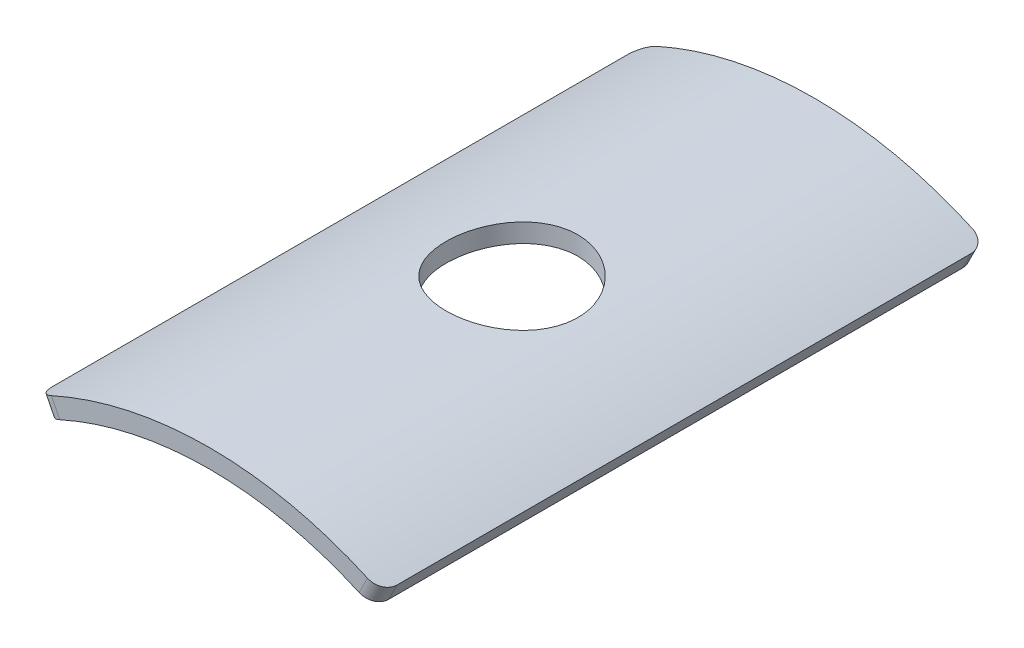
ISO-10303-21;
HEADER;
FILE_DESCRIPTION(('STEP AP214'),'2;1');
FILE_NAME('part.step','',(''),(''),'','','');
FILE_SCHEMA(('AUTOMOTIVE_DESIGN { 1 0 10303 214 1 1 1 1 }'));
ENDSEC;
DATA;
#1=APPLICATION_CONTEXT('core data for automotive mechanical design processes');
#2=APPLICATION_PROTOCOL_DEFINITION('international standard','automotive_design',2000,#1);
#3=PRODUCT_CONTEXT('',#1,'mechanical');
#4=PRODUCT('Part','Part','',(#3));
#5=PRODUCT_RELATED_PRODUCT_CATEGORY('part','',(#4));
#6=PRODUCT_DEFINITION_FORMATION('','',#4);
#7=PRODUCT_DEFINITION_CONTEXT('part definition',#1,'design');
#8=PRODUCT_DEFINITION('design','',#6,#7);
#9=PRODUCT_DEFINITION_SHAPE('','',#8);
#10=(LENGTH_UNIT() NAMED_UNIT(*) SI_UNIT(.MILLI.,.METRE.));
#11=(NAMED_UNIT(*) PLANE_ANGLE_UNIT() SI_UNIT($,.RADIAN.));
#12=(NAMED_UNIT(*) SI_UNIT($,.STERADIAN.) SOLID_ANGLE_UNIT());
#13=UNCERTAINTY_MEASURE_WITH_UNIT(LENGTH_MEASURE(1.E-05),#10,'distance_accuracy_value','');
#14=(GEOMETRIC_REPRESENTATION_CONTEXT(3) GLOBAL_UNCERTAINTY_ASSIGNED_CONTEXT((#13)) GLOBAL_UNIT_ASSIGNED_CONTEXT((#10,
#11,#12)) REPRESENTATION_CONTEXT('',''));
#15=CARTESIAN_POINT('',(0.,0.,0.));
#16=DIRECTION('',(0.,0.,1.));
#17=DIRECTION('',(1.,0.,0.));
#18=AXIS2_PLACEMENT_3D('',#15,#16,#17);
#19=CARTESIAN_POINT('',(0.,-21.0105,19.5));
#20=DIRECTION('',(0.,0.,-1.));
#21=DIRECTION('',(-1.,0.,0.));
#22=AXIS2_PLACEMENT_3D('',#19,#20,#21);
#23=CYLINDRICAL_SURFACE('',#22,23.5105);
#24=DIRECTION('',(0.,0.,-1.));
#25=VECTOR('',#24,1.);
#26=CARTESIAN_POINT('',(-10.55,0.,19.5));
#27=LINE('',#26,#25);
#28=CARTESIAN_POINT('',(-10.55,0.,18.5));
#29=VERTEX_POINT('',#28);
#30=CARTESIAN_POINT('',(-10.55,0.,-18.5));
#31=VERTEX_POINT('',#30);
#32=EDGE_CURVE('E106',#29,#31,#27,.T.);
#33=ORIENTED_EDGE('',*,*,#32,.T.);
#34=CARTESIAN_POINT('',(-10.55,0.,-18.5));
#35=CARTESIAN_POINT('',(-10.5499997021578,-1.76009192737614E-07,-18.5281342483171));
#36=CARTESIAN_POINT('',(-10.5489382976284,0.000533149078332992,-18.5562550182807));
#37=CARTESIAN_POINT('',(-10.5447030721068,0.00265910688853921,-18.6122953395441));
#38=CARTESIAN_POINT('',(-10.5415293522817,0.00425168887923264,-18.6402149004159));
#39=CARTESIAN_POINT('',(-10.5288681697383,0.0105998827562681,-18.7233231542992));
#40=CARTESIAN_POINT('',(-10.516240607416,0.0169259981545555,-18.7779551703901));
#41=CARTESIAN_POINT('',(-10.4829400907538,0.0335471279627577,-18.8840711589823));
#42=CARTESIAN_POINT('',(-10.4622632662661,0.0438440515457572,-18.9355536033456));
#43=CARTESIAN_POINT('',(-10.4134190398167,0.0680448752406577,-19.0339081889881));
#44=CARTESIAN_POINT('',(-10.3852529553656,0.0819481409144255,-19.0807811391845));
#45=CARTESIAN_POINT('',(-10.3221899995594,0.112881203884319,-19.1685824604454));
#46=CARTESIAN_POINT('',(-10.28729370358,0.129910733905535,-19.2095113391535));
#47=CARTESIAN_POINT('',(-10.2117060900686,0.166525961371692,-19.284277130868));
#48=CARTESIAN_POINT('',(-10.1710136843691,0.186112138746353,-19.3181127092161));
#49=CARTESIAN_POINT('',(-10.0849648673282,0.227187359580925,-19.3777164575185));
#50=CARTESIAN_POINT('',(-10.0396090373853,0.248676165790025,-19.4034856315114));
#51=CARTESIAN_POINT('',(-9.94548813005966,0.292869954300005,-19.4462243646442));
#52=CARTESIAN_POINT('',(-9.89672502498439,0.315574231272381,-19.4631989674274));
#53=CARTESIAN_POINT('',(-9.81419008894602,0.35364259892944,-19.4836714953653));
#54=CARTESIAN_POINT('',(-9.78098069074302,0.368867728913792,-19.4897915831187));
#55=CARTESIAN_POINT('',(-9.71412690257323,0.39932741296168,-19.4979553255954));
#56=CARTESIAN_POINT('',(-9.6804832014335,0.414561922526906,-19.5000047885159));
#57=CARTESIAN_POINT('',(-9.64678784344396,0.429721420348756,-19.5));
#58=B_SPLINE_CURVE_WITH_KNOTS('',3,(#34,#35,#36,#37,#38,#39,#40,#41,#42,#43,#44,#45,#46,#47,#48,
#49,#50,#51,#52,#53,#54,#55,#56,#57),.UNSPECIFIED.,.F.,.F.,(4,2,2,2,2,2,2,2,2,2,2,4),(0.,
0.0843509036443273,0.168697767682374,0.337113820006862,0.505610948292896,0.67407845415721,
0.84253156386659,1.01101634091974,1.17948013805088,1.34784721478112,1.45876210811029,
1.56951862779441),.UNSPECIFIED.);
#59=CARTESIAN_POINT('',(-9.64678784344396,0.429721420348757,-19.5));
#60=VERTEX_POINT('',#59);
#61=EDGE_CURVE('E101',#31,#60,#58,.T.);
#62=ORIENTED_EDGE('',*,*,#61,.T.);
#63=CARTESIAN_POINT('',(0.,-21.0105,-19.5));
#64=DIRECTION('',(0.,0.,-1.));
#65=DIRECTION('',(-1.,0.,0.));
#66=AXIS2_PLACEMENT_3D('',#63,#64,#65);
#67=CIRCLE('',#66,23.5105);
#68=CARTESIAN_POINT('',(9.64678784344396,0.42972142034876,-19.5));
#69=VERTEX_POINT('',#68);
#70=EDGE_CURVE('E104',#60,#69,#67,.T.);
#71=ORIENTED_EDGE('',*,*,#70,.T.);
#72=CARTESIAN_POINT('',(9.64678784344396,0.429721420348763,-19.5));
#73=CARTESIAN_POINT('',(9.67244299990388,0.41817847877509,-19.4999998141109));
#74=CARTESIAN_POINT('',(9.69806496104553,0.406594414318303,-19.4988142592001));
#75=CARTESIAN_POINT('',(9.74908504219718,0.383418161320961,-19.4940835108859));
#76=CARTESIAN_POINT('',(9.77448317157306,0.371825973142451,-19.490538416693));
#77=CARTESIAN_POINT('',(9.85002634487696,0.337184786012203,-19.4763957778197));
#78=CARTESIAN_POINT('',(9.89960520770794,0.314232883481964,-19.4622907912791));
#79=CARTESIAN_POINT('',(9.99576272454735,0.269329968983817,-19.4251118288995));
#80=CARTESIAN_POINT('',(10.0423398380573,0.247379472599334,-19.4020332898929));
#81=CARTESIAN_POINT('',(10.1311988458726,0.205174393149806,-19.3475617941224));
#82=CARTESIAN_POINT('',(10.1734815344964,0.184919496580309,-19.3161703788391));
#83=CARTESIAN_POINT('',(10.2525718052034,0.146775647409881,-19.245979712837));
#84=CARTESIAN_POINT('',(10.2893820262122,0.128885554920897,-19.2071840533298));
#85=CARTESIAN_POINT('',(10.3565609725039,0.0960548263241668,-19.123265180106));
#86=CARTESIAN_POINT('',(10.3869284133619,0.0811147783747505,-19.0781407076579));
#87=CARTESIAN_POINT('',(10.4404035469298,0.054695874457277,-18.9828380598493));
#88=CARTESIAN_POINT('',(10.4635083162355,0.043218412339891,-18.9326578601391));
#89=CARTESIAN_POINT('',(10.5018146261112,0.0241371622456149,-18.8286891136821));
#90=CARTESIAN_POINT('',(10.5170207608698,0.0165311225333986,-18.774902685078));
#91=CARTESIAN_POINT('',(10.5353652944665,0.00734371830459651,-18.6839921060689));
#92=CARTESIAN_POINT('',(10.5408504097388,0.0045924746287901,-18.6474381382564));
#93=CARTESIAN_POINT('',(10.5481670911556,0.000920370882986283,-18.5739278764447));
#94=CARTESIAN_POINT('',(10.5500038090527,-3.07014575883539E-06,-18.5369722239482));
#95=CARTESIAN_POINT('',(10.55,0.,-18.5));
#96=B_SPLINE_CURVE_WITH_KNOTS('',3,(#72,#73,#74,#75,#76,#77,#78,#79,#80,#81,#82,#83,#84,#85,#86,
#87,#88,#89,#90,#91,#92,#93,#94,#95),.UNSPECIFIED.,.F.,.F.,(4,2,2,2,2,2,2,2,2,2,2,4),(0.,
0.0843452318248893,0.168686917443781,0.337094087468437,0.50558700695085,0.674048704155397,
0.842428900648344,1.01084263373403,1.1793240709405,1.34770740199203,1.4586915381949,
1.56951884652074),.UNSPECIFIED.);
#97=CARTESIAN_POINT('',(10.55,0.,-18.5));
#98=VERTEX_POINT('',#97);
#99=EDGE_CURVE('E111',#69,#98,#96,.T.);
#100=ORIENTED_EDGE('',*,*,#99,.T.);
#101=DIRECTION('',(0.,0.,-1.));
#102=VECTOR('',#101,1.);
#103=CARTESIAN_POINT('',(10.55,0.,19.5));
#104=LINE('',#103,#102);
#105=CARTESIAN_POINT('',(10.55,0.,18.5));
#106=VERTEX_POINT('',#105);
#107=EDGE_CURVE('E220',#106,#98,#104,.T.);
#108=ORIENTED_EDGE('',*,*,#107,.F.);
#109=CARTESIAN_POINT('',(10.55,0.,18.5));
#110=CARTESIAN_POINT('',(10.5499997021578,-1.76009189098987E-07,18.5281342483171));
#111=CARTESIAN_POINT('',(10.5489382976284,0.000533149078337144,18.5562550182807));
#112=CARTESIAN_POINT('',(10.5447030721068,0.00265910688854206,18.6122953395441));
#113=CARTESIAN_POINT('',(10.5415293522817,0.00425168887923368,18.6402149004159));
#114=CARTESIAN_POINT('',(10.5288681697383,0.0105998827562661,18.7233231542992));
#115=CARTESIAN_POINT('',(10.516240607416,0.0169259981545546,18.7779551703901));
#116=CARTESIAN_POINT('',(10.4829400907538,0.0335471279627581,18.8840711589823));
#117=CARTESIAN_POINT('',(10.462263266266,0.0438440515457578,18.9355536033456));
#118=CARTESIAN_POINT('',(10.4134190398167,0.0680448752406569,19.0339081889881));
#119=CARTESIAN_POINT('',(10.3852529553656,0.0819481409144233,19.0807811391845));
#120=CARTESIAN_POINT('',(10.3221899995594,0.11288120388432,19.1685824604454));
#121=CARTESIAN_POINT('',(10.28729370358,0.129910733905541,19.2095113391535));
#122=CARTESIAN_POINT('',(10.2117060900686,0.166525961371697,19.284277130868));
#123=CARTESIAN_POINT('',(10.1710136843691,0.186112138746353,19.3181127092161));
#124=CARTESIAN_POINT('',(10.0849648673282,0.227187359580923,19.3777164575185));
#125=CARTESIAN_POINT('',(10.0396090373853,0.248676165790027,19.4034856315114));
#126=CARTESIAN_POINT('',(9.94548813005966,0.292869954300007,19.4462243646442));
#127=CARTESIAN_POINT('',(9.89672502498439,0.315574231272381,19.4631989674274));
#128=CARTESIAN_POINT('',(9.81419008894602,0.353642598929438,19.4836714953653));
#129=CARTESIAN_POINT('',(9.78098069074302,0.368867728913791,19.4897915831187));
#130=CARTESIAN_POINT('',(9.71412690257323,0.399327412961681,19.4979553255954));
#131=CARTESIAN_POINT('',(9.68048320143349,0.414561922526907,19.5000047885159));
#132=CARTESIAN_POINT('',(9.64678784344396,0.429721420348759,19.5));
#133=B_SPLINE_CURVE_WITH_KNOTS('',3,(#109,#110,#111,#112,#113,#114,#115,#116,#117,#118,#119,
#120,#121,#122,#123,#124,#125,#126,#127,#128,#129,#130,#131,#132),.UNSPECIFIED.,.F.,.F.,(4,2,2,
2,2,2,2,2,2,2,2,4),(0.,0.0843509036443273,0.168697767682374,0.337113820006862,0.505610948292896,
0.67407845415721,0.84253156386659,1.01101634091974,1.17948013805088,1.34784721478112,
1.45876210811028,1.56951862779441),.UNSPECIFIED.);
#134=CARTESIAN_POINT('',(9.64678784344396,0.42972142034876,19.5));
#135=VERTEX_POINT('',#134);
#136=EDGE_CURVE('E52',#106,#135,#133,.T.);
#137=ORIENTED_EDGE('',*,*,#136,.T.);
#138=CARTESIAN_POINT('',(0.,-21.0105,19.5));
#139=DIRECTION('',(0.,0.,-1.));
#140=DIRECTION('',(-1.,0.,0.));
#141=AXIS2_PLACEMENT_3D('',#138,#139,#140);
#142=CIRCLE('',#141,23.5105);
#143=CARTESIAN_POINT('',(-9.64678784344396,0.429721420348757,19.5));
#144=VERTEX_POINT('',#143);
#145=EDGE_CURVE('E252',#144,#135,#142,.T.);
#146=ORIENTED_EDGE('',*,*,#145,.F.);
#147=CARTESIAN_POINT('',(-9.64678784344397,0.429721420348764,19.5));
#148=CARTESIAN_POINT('',(-9.67244299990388,0.418178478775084,19.4999998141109));
#149=CARTESIAN_POINT('',(-9.69806496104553,0.406594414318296,19.4988142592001));
#150=CARTESIAN_POINT('',(-9.74908504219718,0.383418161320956,19.4940835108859));
#151=CARTESIAN_POINT('',(-9.77448317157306,0.37182597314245,19.490538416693));
#152=CARTESIAN_POINT('',(-9.85002634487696,0.337184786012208,19.4763957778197));
#153=CARTESIAN_POINT('',(-9.89960520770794,0.314232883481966,19.4622907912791));
#154=CARTESIAN_POINT('',(-9.99576272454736,0.269329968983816,19.4251118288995));
#155=CARTESIAN_POINT('',(-10.0423398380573,0.247379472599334,19.4020332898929));
#156=CARTESIAN_POINT('',(-10.1311988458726,0.205174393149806,19.3475617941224));
#157=CARTESIAN_POINT('',(-10.1734815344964,0.184919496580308,19.3161703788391));
#158=CARTESIAN_POINT('',(-10.2525718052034,0.146775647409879,19.245979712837));
#159=CARTESIAN_POINT('',(-10.2893820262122,0.128885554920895,19.2071840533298));
#160=CARTESIAN_POINT('',(-10.3565609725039,0.0960548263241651,19.123265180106));
#161=CARTESIAN_POINT('',(-10.3869284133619,0.0811147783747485,19.0781407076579));
#162=CARTESIAN_POINT('',(-10.4404035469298,0.0546958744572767,18.9828380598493));
#163=CARTESIAN_POINT('',(-10.4635083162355,0.0432184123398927,18.9326578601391));
#164=CARTESIAN_POINT('',(-10.5018146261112,0.0241371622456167,18.8286891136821));
#165=CARTESIAN_POINT('',(-10.5170207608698,0.0165311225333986,18.774902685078));
#166=CARTESIAN_POINT('',(-10.5353652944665,0.00734371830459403,18.6839921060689));
#167=CARTESIAN_POINT('',(-10.5408504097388,0.00459247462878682,18.6474381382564));
#168=CARTESIAN_POINT('',(-10.5481670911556,0.000920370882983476,18.5739278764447));
#169=CARTESIAN_POINT('',(-10.5500038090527,-3.07014576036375E-06,18.5369722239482));
#170=CARTESIAN_POINT('',(-10.55,0.,18.5));
#171=B_SPLINE_CURVE_WITH_KNOTS('',3,(#147,#148,#149,#150,#151,#152,#153,#154,#155,#156,#157,
#158,#159,#160,#161,#162,#163,#164,#165,#166,#167,#168,#169,#170),.UNSPECIFIED.,.F.,.F.,(4,2,2,
2,2,2,2,2,2,2,2,4),(0.,0.0843452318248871,0.168686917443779,0.337094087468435,0.505587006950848,
0.674048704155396,0.842428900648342,1.01084263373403,1.1793240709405,1.34770740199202,
1.4586915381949,1.56951884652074),.UNSPECIFIED.);
#172=EDGE_CURVE('E185',#144,#29,#171,.T.);
#173=ORIENTED_EDGE('',*,*,#172,.T.);
#174=EDGE_LOOP('',(#33,#62,#71,#100,#108,#137,#146,#173));
#175=FACE_BOUND('',#174,.T.);
#176=CARTESIAN_POINT('',(0.,2.5,-4.25));
#177=CARTESIAN_POINT('',(0.236657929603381,2.49999577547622,-4.2499907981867));
#178=CARTESIAN_POINT('',(0.473437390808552,2.49638967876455,-4.23016603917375));
#179=CARTESIAN_POINT('',(0.940334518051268,2.48235170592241,-4.15143578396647));
#180=CARTESIAN_POINT('',(1.17044621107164,2.47191389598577,-4.09249631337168));
#181=CARTESIAN_POINT('',(1.61718701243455,2.44538115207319,-3.93739167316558));
#182=CARTESIAN_POINT('',(1.83382772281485,2.429291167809,-3.84125906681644));
#183=CARTESIAN_POINT('',(2.24788244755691,2.39321513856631,-3.61458710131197));
#184=CARTESIAN_POINT('',(2.44529822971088,2.37322945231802,-3.48405090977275));
#185=CARTESIAN_POINT('',(2.81752643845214,2.33132160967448,-3.19072863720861));
#186=CARTESIAN_POINT('',(2.99209306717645,2.30938208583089,-3.02763308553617));
#187=CARTESIAN_POINT('',(3.31154231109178,2.26616952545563,-2.6744876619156));
#188=CARTESIAN_POINT('',(3.45642288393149,2.24489653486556,-2.48443593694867));
#189=CARTESIAN_POINT('',(3.71339733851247,2.20525710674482,-2.08105208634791));
#190=CARTESIAN_POINT('',(3.82524350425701,2.18691308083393,-1.86755975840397));
#191=CARTESIAN_POINT('',(4.01138903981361,2.15545210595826,-1.42442905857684));
#192=CARTESIAN_POINT('',(4.08569140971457,2.14233473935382,-1.19479197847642));
#193=CARTESIAN_POINT('',(4.19385609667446,2.12298649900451,-0.728512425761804));
#194=CARTESIAN_POINT('',(4.22814567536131,2.11668292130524,-0.491972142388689));
#195=CARTESIAN_POINT('',(4.25663713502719,2.11145654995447,-0.0164181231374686));
#196=CARTESIAN_POINT('',(4.25084235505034,2.11253314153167,0.222595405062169));
#197=CARTESIAN_POINT('',(4.19967656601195,2.12187920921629,0.69323109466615));
#198=CARTESIAN_POINT('',(4.15478941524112,2.13006074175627,0.924907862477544));
#199=CARTESIAN_POINT('',(4.02747417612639,2.15255686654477,1.37738719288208));
#200=CARTESIAN_POINT('',(3.94504459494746,2.16687170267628,1.59818932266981));
#201=CARTESIAN_POINT('',(3.74450538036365,2.20011447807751,2.02407833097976));
#202=CARTESIAN_POINT('',(3.62619851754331,2.21906780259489,2.22907027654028));
#203=CARTESIAN_POINT('',(3.35740270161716,2.2594349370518,2.61647551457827));
#204=CARTESIAN_POINT('',(3.20691070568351,2.28084897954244,2.79888666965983));
#205=CARTESIAN_POINT('',(2.87539853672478,2.32410901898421,3.1387497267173));
#206=CARTESIAN_POINT('',(2.69396406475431,2.34595675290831,3.29579756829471));
#207=CARTESIAN_POINT('',(2.30710848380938,2.38733411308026,3.57728568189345));
#208=CARTESIAN_POINT('',(2.10168716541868,2.40686371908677,3.7017256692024));
#209=CARTESIAN_POINT('',(1.67228152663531,2.44143968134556,3.91451752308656));
#210=CARTESIAN_POINT('',(1.4482770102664,2.45648107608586,4.00282949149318));
#211=CARTESIAN_POINT('',(0.988281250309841,2.48034707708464,4.14046123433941));
#212=CARTESIAN_POINT('',(0.752291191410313,2.48917229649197,4.18978485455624));
#213=CARTESIAN_POINT('',(0.278501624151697,2.49952795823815,4.24748229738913));
#214=CARTESIAN_POINT('',(0.0407716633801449,2.50115707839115,4.25641009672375));
#215=CARTESIAN_POINT('',(-0.432785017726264,2.49720878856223,4.23454541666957));
#216=CARTESIAN_POINT('',(-0.668611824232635,2.49163170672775,4.20375474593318));
#217=CARTESIAN_POINT('',(-1.12992622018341,2.47395897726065,4.10378783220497));
#218=CARTESIAN_POINT('',(-1.35547608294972,2.46191060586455,4.03488987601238));
#219=CARTESIAN_POINT('',(-1.79182352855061,2.43264061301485,3.86096379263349));
#220=CARTESIAN_POINT('',(-2.00262016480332,2.41541865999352,3.75593334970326));
#221=CARTESIAN_POINT('',(-2.40585581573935,2.37746588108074,3.51148333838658));
#222=CARTESIAN_POINT('',(-2.59808481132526,2.3567009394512,3.37172273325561));
#223=CARTESIAN_POINT('',(-2.95655971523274,2.31405813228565,3.06224370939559));
#224=CARTESIAN_POINT('',(-3.12280337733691,2.2921801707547,2.89252270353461));
#225=CARTESIAN_POINT('',(-3.42667641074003,2.24945249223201,2.52544027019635));
#226=CARTESIAN_POINT('',(-3.56392895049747,2.22861871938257,2.32776474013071));
#227=CARTESIAN_POINT('',(-3.80328016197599,2.19065120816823,1.91183782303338));
#228=CARTESIAN_POINT('',(-3.905380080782,2.17351733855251,1.69358716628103));
#229=CARTESIAN_POINT('',(-4.07098362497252,2.14501290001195,1.24369445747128));
#230=CARTESIAN_POINT('',(-4.13466493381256,2.13361583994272,1.01211956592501));
#231=CARTESIAN_POINT('',(-4.22217558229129,2.11781285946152,0.541333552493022));
#232=CARTESIAN_POINT('',(-4.24600906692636,2.11340621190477,0.302123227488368));
#233=CARTESIAN_POINT('',(-4.25301649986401,2.11211804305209,-0.173372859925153));
#234=CARTESIAN_POINT('',(-4.23678439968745,2.11512659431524,-0.409649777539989));
#235=CARTESIAN_POINT('',(-4.1654164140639,2.12808703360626,-0.876049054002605));
#236=CARTESIAN_POINT('',(-4.11028072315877,2.13803888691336,-1.10617144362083));
#237=CARTESIAN_POINT('',(-3.96291367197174,2.16371981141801,-1.55343987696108));
#238=CARTESIAN_POINT('',(-3.87074223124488,2.17943954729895,-1.77060623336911));
#239=CARTESIAN_POINT('',(-3.65198360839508,2.21489237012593,-2.18648814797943));
#240=CARTESIAN_POINT('',(-3.52539423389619,2.23462571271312,-2.38520252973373));
#241=CARTESIAN_POINT('',(-3.23930974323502,2.27622599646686,-2.76152369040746));
#242=CARTESIAN_POINT('',(-3.07938073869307,2.298118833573,-2.93879781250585));
#243=CARTESIAN_POINT('',(-2.73206543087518,2.34137338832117,-3.26419287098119));
#244=CARTESIAN_POINT('',(-2.54467282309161,2.36273498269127,-3.4123070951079));
#245=CARTESIAN_POINT('',(-2.14589459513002,2.40272695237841,-3.6763162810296));
#246=CARTESIAN_POINT('',(-1.93432313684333,2.42133324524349,-3.79193427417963));
#247=CARTESIAN_POINT('',(-1.49449700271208,2.45348356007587,-3.98580271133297));
#248=CARTESIAN_POINT('',(-1.26625855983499,2.46703243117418,-4.06408896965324));
#249=CARTESIAN_POINT('',(-0.864394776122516,2.48471331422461,-4.16480555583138));
#250=CARTESIAN_POINT('',(-0.693147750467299,2.49041403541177,-4.19670004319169));
#251=CARTESIAN_POINT('',(-0.347955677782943,2.49805888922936,-4.23930041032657));
#252=CARTESIAN_POINT('',(-0.174010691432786,2.50000310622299,-4.25000676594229));
#253=CARTESIAN_POINT('',(0.,2.5,-4.25));
#254=B_SPLINE_CURVE_WITH_KNOTS('',3,(#176,#177,#178,#179,#180,#181,#182,#183,#184,#185,#186,
#187,#188,#189,#190,#191,#192,#193,#194,#195,#196,#197,#198,#199,#200,#201,#202,#203,#204,#205,
#206,#207,#208,#209,#210,#211,#212,#213,#214,#215,#216,#217,#218,#219,#220,#221,#222,#223,#224,
#225,#226,#227,#228,#229,#230,#231,#232,#233,#234,#235,#236,#237,#238,#239,#240,#241,#242,#243,
#244,#245,#246,#247,#248,#249,#250,#251,#252,#253),.UNSPECIFIED.,.T.,.F.,(4,2,2,2,2,2,2,2,2,2,2,
2,2,2,2,2,2,2,2,2,2,2,2,2,2,2,2,2,2,2,2,2,2,2,2,2,2,2,4),(0.,0.709337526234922,1.41929197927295,
2.12862625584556,2.83789524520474,3.55425753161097,4.27066908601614,4.99232383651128,
5.71392091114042,6.42774005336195,7.14149973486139,7.84654856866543,8.55162544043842,
9.26065086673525,9.96974335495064,10.6892066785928,11.4086762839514,12.1289383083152,
12.8491292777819,13.5594132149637,14.269664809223,14.9747968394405,15.6799740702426,
16.392370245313,17.1048279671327,17.8260429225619,18.5472322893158,19.2650601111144,
19.9828132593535,20.6899901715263,21.3971635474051,22.1031973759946,22.8092761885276,
23.5251924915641,24.2412733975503,24.9632842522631,25.6846010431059,26.2061769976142,
26.7277412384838),.UNSPECIFIED.);
#255=CARTESIAN_POINT('',(0.,2.5,-4.25));
#256=VERTEX_POINT('',#255);
#257=EDGE_CURVE('E123',#256,#256,#254,.T.);
#258=ORIENTED_EDGE('',*,*,#257,.F.);
#259=EDGE_LOOP('',(#258));
#260=FACE_BOUND('',#259,.T.);
#261=ADVANCED_FACE('F36',(#175,#260),#23,.F.);
#262=CARTESIAN_POINT('',(0.,-21.0105,19.5));
#263=DIRECTION('',(0.,0.,-1.));
#264=DIRECTION('',(-1.,0.,0.));
#265=AXIS2_PLACEMENT_3D('',#262,#263,#264);
#266=CYLINDRICAL_SURFACE('',#265,24.7105);
#267=CARTESIAN_POINT('',(0.,-21.0105,-19.5));
#268=DIRECTION('',(0.,0.,1.));
#269=DIRECTION('',(1.,0.,0.));
#270=AXIS2_PLACEMENT_3D('',#267,#268,#269);
#271=CIRCLE('',#270,24.7105);
#272=CARTESIAN_POINT('',(-10.1857346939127,1.50304301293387,-19.5));
#273=VERTEX_POINT('',#272);
#274=CARTESIAN_POINT('',(10.1857346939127,1.50304301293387,-19.5));
#275=VERTEX_POINT('',#274);
#276=EDGE_CURVE('E122',#273,#275,#271,.F.);
#277=ORIENTED_EDGE('',*,*,#276,.F.);
#278=CARTESIAN_POINT('',(-10.1857346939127,1.50304301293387,-19.5));
#279=CARTESIAN_POINT('',(-10.2113661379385,1.49144695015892,-19.4999998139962));
#280=CARTESIAN_POINT('',(-10.2369653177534,1.47981209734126,-19.4988140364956));
#281=CARTESIAN_POINT('',(-10.287941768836,1.45653913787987,-19.494082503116));
#282=CARTESIAN_POINT('',(-10.3133190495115,1.44490103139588,-19.490536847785));
#283=CARTESIAN_POINT('',(-10.3888027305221,1.41012984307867,-19.4763921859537));
#284=CARTESIAN_POINT('',(-10.4383459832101,1.38710141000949,-19.4622853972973));
#285=CARTESIAN_POINT('',(-10.534440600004,1.34206578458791,-19.4251026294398));
#286=CARTESIAN_POINT('',(-10.5809904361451,1.32005911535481,-19.4020221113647));
#287=CARTESIAN_POINT('',(-10.669802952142,1.2777600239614,-19.3475467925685));
#288=CARTESIAN_POINT('',(-10.7120664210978,1.2574672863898,-19.3161535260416));
#289=CARTESIAN_POINT('',(-10.7911269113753,1.21926206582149,-19.245957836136));
#290=CARTESIAN_POINT('',(-10.8279263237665,1.20134854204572,-19.2071586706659));
#291=CARTESIAN_POINT('',(-10.8950882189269,1.16848249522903,-19.1232325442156));
#292=CARTESIAN_POINT('',(-10.9254494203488,1.15353056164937,-19.0781043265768));
#293=CARTESIAN_POINT('',(-10.9789141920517,1.12709577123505,-18.9827950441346));
#294=CARTESIAN_POINT('',(-11.0020149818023,1.11561424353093,-18.9326120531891));
#295=CARTESIAN_POINT('',(-11.0403145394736,1.09652887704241,-18.8286379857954));
#296=CARTESIAN_POINT('',(-11.0555179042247,1.08892278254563,-18.774849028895));
#297=CARTESIAN_POINT('',(-11.073855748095,1.07973755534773,-18.683945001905));
#298=CARTESIAN_POINT('',(-11.0793379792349,1.07698761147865,-18.6474002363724));
#299=CARTESIAN_POINT('',(-11.0866508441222,1.07331733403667,-18.5739087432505));
#300=CARTESIAN_POINT('',(-11.0884866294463,1.07239441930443,-18.5369626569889));
#301=CARTESIAN_POINT('',(-11.088482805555,1.07239743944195,-18.5));
#302=B_SPLINE_CURVE_WITH_KNOTS('',3,(#278,#279,#280,#281,#282,#283,#284,#285,#286,#287,#288,
#289,#290,#291,#292,#293,#294,#295,#296,#297,#298,#299,#300,#301),.UNSPECIFIED.,.F.,.F.,(4,2,2,
2,2,2,2,2,2,2,2,4),(0.,0.0843459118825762,0.168688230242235,0.337096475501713,0.505590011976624,
0.674052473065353,0.842440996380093,1.01086300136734,1.17934942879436,1.34773767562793,
1.45869319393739,1.56949184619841),.UNSPECIFIED.);
#303=CARTESIAN_POINT('',(-11.088482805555,1.07239743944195,-18.5));
#304=VERTEX_POINT('',#303);
#305=EDGE_CURVE('E126',#273,#304,#302,.T.);
#306=ORIENTED_EDGE('',*,*,#305,.T.);
#307=DIRECTION('',(0.,0.,-1.));
#308=VECTOR('',#307,1.);
#309=CARTESIAN_POINT('',(-11.088482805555,1.07239743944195,19.5));
#310=LINE('',#309,#308);
#311=CARTESIAN_POINT('',(-11.088482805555,1.07239743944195,18.5));
#312=VERTEX_POINT('',#311);
#313=EDGE_CURVE('E216',#312,#304,#310,.T.);
#314=ORIENTED_EDGE('',*,*,#313,.F.);
#315=CARTESIAN_POINT('',(-11.088482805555,1.07239743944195,18.5));
#316=CARTESIAN_POINT('',(-11.0884825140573,1.07239727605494,18.528134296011));
#317=CARTESIAN_POINT('',(-11.0874210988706,1.0729305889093,18.5562551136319));
#318=CARTESIAN_POINT('',(-11.083185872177,1.07505658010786,18.6122955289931));
#319=CARTESIAN_POINT('',(-11.0800121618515,1.07664920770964,18.6402151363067));
#320=CARTESIAN_POINT('',(-11.0673511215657,1.08299778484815,18.723323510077));
#321=CARTESIAN_POINT('',(-11.0547238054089,1.08932448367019,18.7779555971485));
#322=CARTESIAN_POINT('',(-11.0214251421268,1.10594954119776,18.8840717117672));
#323=CARTESIAN_POINT('',(-11.0007499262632,1.1162498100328,18.9355542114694));
#324=CARTESIAN_POINT('',(-10.951911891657,1.14046332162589,19.0339089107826));
#325=CARTESIAN_POINT('',(-10.9237503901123,1.15437592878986,19.080781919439));
#326=CARTESIAN_POINT('',(-10.8607012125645,1.18533765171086,19.1685837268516));
#327=CARTESIAN_POINT('',(-10.8258140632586,1.20238652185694,19.2095129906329));
#328=CARTESIAN_POINT('',(-10.7502512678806,1.23905432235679,19.2842795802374));
#329=CARTESIAN_POINT('',(-10.7095745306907,1.25867373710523,19.3181155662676));
#330=CARTESIAN_POINT('',(-10.6235636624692,1.29983339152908,19.3777209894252));
#331=CARTESIAN_POINT('',(-10.5782299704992,1.32137345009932,19.4034911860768));
#332=CARTESIAN_POINT('',(-10.484161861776,1.365689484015,19.4462311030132));
#333=CARTESIAN_POINT('',(-10.4354294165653,1.38846474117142,19.4632058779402));
#334=CARTESIAN_POINT('',(-10.3529602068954,1.42666404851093,19.4836756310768));
#335=CARTESIAN_POINT('',(-10.3197836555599,1.44194335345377,19.4897941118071));
#336=CARTESIAN_POINT('',(-10.2529991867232,1.47251978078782,19.4979557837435));
#337=CARTESIAN_POINT('',(-10.2193919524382,1.48781684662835,19.5000047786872));
#338=CARTESIAN_POINT('',(-10.1857346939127,1.50304301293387,19.5));
#339=B_SPLINE_CURVE_WITH_KNOTS('',3,(#315,#316,#317,#318,#319,#320,#321,#322,#323,#324,#325,
#326,#327,#328,#329,#330,#331,#332,#333,#334,#335,#336,#337,#338),.UNSPECIFIED.,.F.,.F.,(4,2,2,
2,2,2,2,2,2,2,2,4),(0.,0.0843510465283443,0.168698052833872,0.337114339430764,0.505611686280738,
0.674079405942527,0.84253393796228,1.01102025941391,1.17949071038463,1.34786423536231,
1.45875707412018,1.56949164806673),.UNSPECIFIED.);
#340=CARTESIAN_POINT('',(-10.1857346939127,1.50304301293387,19.5));
#341=VERTEX_POINT('',#340);
#342=EDGE_CURVE('E129',#312,#341,#339,.T.);
#343=ORIENTED_EDGE('',*,*,#342,.T.);
#344=CARTESIAN_POINT('',(0.,-21.0105,19.5));
#345=DIRECTION('',(0.,0.,1.));
#346=DIRECTION('',(1.,0.,0.));
#347=AXIS2_PLACEMENT_3D('',#344,#345,#346);
#348=CIRCLE('',#347,24.7105);
#349=CARTESIAN_POINT('',(10.1857346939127,1.50304301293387,19.5));
#350=VERTEX_POINT('',#349);
#351=EDGE_CURVE('E222',#341,#350,#348,.F.);
#352=ORIENTED_EDGE('',*,*,#351,.T.);
#353=CARTESIAN_POINT('',(10.1857346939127,1.50304301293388,19.5));
#354=CARTESIAN_POINT('',(10.2113661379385,1.49144695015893,19.4999998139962));
#355=CARTESIAN_POINT('',(10.2369653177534,1.47981209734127,19.4988140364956));
#356=CARTESIAN_POINT('',(10.287941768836,1.45653913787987,19.494082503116));
#357=CARTESIAN_POINT('',(10.3133190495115,1.44490103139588,19.490536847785));
#358=CARTESIAN_POINT('',(10.3888027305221,1.41012984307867,19.4763921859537));
#359=CARTESIAN_POINT('',(10.4383459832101,1.38710141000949,19.4622853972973));
#360=CARTESIAN_POINT('',(10.534440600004,1.34206578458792,19.4251026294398));
#361=CARTESIAN_POINT('',(10.5809904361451,1.32005911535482,19.4020221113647));
#362=CARTESIAN_POINT('',(10.669802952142,1.2777600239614,19.3475467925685));
#363=CARTESIAN_POINT('',(10.7120664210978,1.2574672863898,19.3161535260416));
#364=CARTESIAN_POINT('',(10.7911269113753,1.21926206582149,19.245957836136));
#365=CARTESIAN_POINT('',(10.8279263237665,1.20134854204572,19.2071586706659));
#366=CARTESIAN_POINT('',(10.8950882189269,1.16848249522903,19.1232325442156));
#367=CARTESIAN_POINT('',(10.9254494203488,1.15353056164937,19.0781043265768));
#368=CARTESIAN_POINT('',(10.9789141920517,1.12709577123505,18.9827950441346));
#369=CARTESIAN_POINT('',(11.0020149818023,1.11561424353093,18.9326120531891));
#370=CARTESIAN_POINT('',(11.0403145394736,1.09652887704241,18.8286379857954));
#371=CARTESIAN_POINT('',(11.0555179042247,1.08892278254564,18.774849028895));
#372=CARTESIAN_POINT('',(11.073855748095,1.07973755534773,18.683945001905));
#373=CARTESIAN_POINT('',(11.0793379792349,1.07698761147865,18.6474002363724));
#374=CARTESIAN_POINT('',(11.0866508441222,1.07331733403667,18.5739087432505));
#375=CARTESIAN_POINT('',(11.0884866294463,1.07239441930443,18.5369626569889));
#376=CARTESIAN_POINT('',(11.088482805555,1.07239743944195,18.5));
#377=B_SPLINE_CURVE_WITH_KNOTS('',3,(#353,#354,#355,#356,#357,#358,#359,#360,#361,#362,#363,
#364,#365,#366,#367,#368,#369,#370,#371,#372,#373,#374,#375,#376),.UNSPECIFIED.,.F.,.F.,(4,2,2,
2,2,2,2,2,2,2,2,4),(0.,0.0843459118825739,0.168688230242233,0.337096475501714,0.505590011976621,
0.674052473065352,0.842440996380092,1.01086300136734,1.17934942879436,1.34773767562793,
1.45869319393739,1.56949184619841),.UNSPECIFIED.);
#378=CARTESIAN_POINT('',(11.088482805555,1.07239743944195,18.5));
#379=VERTEX_POINT('',#378);
#380=EDGE_CURVE('E127',#350,#379,#377,.T.);
#381=ORIENTED_EDGE('',*,*,#380,.T.);
#382=DIRECTION('',(0.,0.,-1.));
#383=VECTOR('',#382,1.);
#384=CARTESIAN_POINT('',(11.088482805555,1.07239743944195,19.5));
#385=LINE('',#384,#383);
#386=CARTESIAN_POINT('',(11.088482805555,1.07239743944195,-18.5));
#387=VERTEX_POINT('',#386);
#388=EDGE_CURVE('E217',#379,#387,#385,.T.);
#389=ORIENTED_EDGE('',*,*,#388,.T.);
#390=CARTESIAN_POINT('',(11.088482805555,1.07239743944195,-18.5));
#391=CARTESIAN_POINT('',(11.0884825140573,1.07239727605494,-18.528134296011));
#392=CARTESIAN_POINT('',(11.0874210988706,1.0729305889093,-18.5562551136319));
#393=CARTESIAN_POINT('',(11.083185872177,1.07505658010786,-18.6122955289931));
#394=CARTESIAN_POINT('',(11.0800121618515,1.07664920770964,-18.6402151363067));
#395=CARTESIAN_POINT('',(11.0673511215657,1.08299778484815,-18.723323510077));
#396=CARTESIAN_POINT('',(11.0547238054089,1.08932448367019,-18.7779555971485));
#397=CARTESIAN_POINT('',(11.0214251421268,1.10594954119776,-18.8840717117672));
#398=CARTESIAN_POINT('',(11.0007499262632,1.1162498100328,-18.9355542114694));
#399=CARTESIAN_POINT('',(10.951911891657,1.14046332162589,-19.0339089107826));
#400=CARTESIAN_POINT('',(10.9237503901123,1.15437592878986,-19.080781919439));
#401=CARTESIAN_POINT('',(10.8607012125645,1.18533765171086,-19.1685837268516));
#402=CARTESIAN_POINT('',(10.8258140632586,1.20238652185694,-19.2095129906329));
#403=CARTESIAN_POINT('',(10.7502512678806,1.2390543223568,-19.2842795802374));
#404=CARTESIAN_POINT('',(10.7095745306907,1.25867373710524,-19.3181155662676));
#405=CARTESIAN_POINT('',(10.6235636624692,1.29983339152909,-19.3777209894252));
#406=CARTESIAN_POINT('',(10.5782299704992,1.32137345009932,-19.4034911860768));
#407=CARTESIAN_POINT('',(10.484161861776,1.365689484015,-19.4462311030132));
#408=CARTESIAN_POINT('',(10.4354294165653,1.38846474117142,-19.4632058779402));
#409=CARTESIAN_POINT('',(10.3529602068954,1.42666404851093,-19.4836756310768));
#410=CARTESIAN_POINT('',(10.3197836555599,1.44194335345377,-19.4897941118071));
#411=CARTESIAN_POINT('',(10.2529991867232,1.47251978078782,-19.4979557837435));
#412=CARTESIAN_POINT('',(10.2193919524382,1.48781684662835,-19.5000047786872));
#413=CARTESIAN_POINT('',(10.1857346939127,1.50304301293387,-19.5));
#414=B_SPLINE_CURVE_WITH_KNOTS('',3,(#390,#391,#392,#393,#394,#395,#396,#397,#398,#399,#400,
#401,#402,#403,#404,#405,#406,#407,#408,#409,#410,#411,#412,#413),.UNSPECIFIED.,.F.,.F.,(4,2,2,
2,2,2,2,2,2,2,2,4),(0.,0.0843510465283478,0.168698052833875,0.337114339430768,0.505611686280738,
0.674079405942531,0.842533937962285,1.01102025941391,1.17949071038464,1.34786423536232,
1.45875707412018,1.56949164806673),.UNSPECIFIED.);
#415=EDGE_CURVE('E162',#387,#275,#414,.T.);
#416=ORIENTED_EDGE('',*,*,#415,.T.);
#417=EDGE_LOOP('',(#277,#306,#314,#343,#352,#381,#389,#416));
#418=FACE_BOUND('',#417,.T.);
#419=CARTESIAN_POINT('',(0.,3.7,-4.25));
#420=CARTESIAN_POINT('',(0.236851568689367,3.69999587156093,-4.24999060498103));
#421=CARTESIAN_POINT('',(0.473829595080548,3.69655925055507,-4.23013357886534));
#422=CARTESIAN_POINT('',(0.941131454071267,3.68318089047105,-4.15126757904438));
#423=CARTESIAN_POINT('',(1.17144909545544,3.67323328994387,-4.09222332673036));
#424=CARTESIAN_POINT('',(1.61860233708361,3.64794799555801,-3.93682475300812));
#425=CARTESIAN_POINT('',(1.83544907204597,3.63261482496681,-3.84050173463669));
#426=CARTESIAN_POINT('',(2.24987732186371,3.5982414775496,-3.61336358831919));
#427=CARTESIAN_POINT('',(2.44746087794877,3.5792016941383,-3.48255212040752));
#428=CARTESIAN_POINT('',(2.81978603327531,3.53930740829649,-3.18873819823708));
#429=CARTESIAN_POINT('',(2.99430368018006,3.51843798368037,-3.02545394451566));
#430=CARTESIAN_POINT('',(3.31360786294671,3.4773498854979,-2.67193598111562));
#431=CARTESIAN_POINT('',(3.45839246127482,3.45713125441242,-2.4817005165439));
#432=CARTESIAN_POINT('',(3.71502654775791,3.4194893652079,-2.07813084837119));
#433=CARTESIAN_POINT('',(3.82665300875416,3.40208538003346,-1.86465286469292));
#434=CARTESIAN_POINT('',(4.0123755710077,3.37225120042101,-1.42162632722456));
#435=CARTESIAN_POINT('',(4.08647437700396,3.35982064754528,-1.19207893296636));
#436=CARTESIAN_POINT('',(4.19432936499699,3.34148974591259,-0.725809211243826));
#437=CARTESIAN_POINT('',(4.22847317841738,3.33552669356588,-0.489179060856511));
#438=CARTESIAN_POINT('',(4.25665114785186,3.33061643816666,-0.0134790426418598));
#439=CARTESIAN_POINT('',(4.25068832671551,3.33166870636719,0.22559063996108));
#440=CARTESIAN_POINT('',(4.19913767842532,3.34061298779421,0.696606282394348));
#441=CARTESIAN_POINT('',(4.15398659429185,3.3484296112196,0.928601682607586));
#442=CARTESIAN_POINT('',(4.02602708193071,3.36990375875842,1.38167454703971));
#443=CARTESIAN_POINT('',(3.9432172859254,3.38356149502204,1.60275161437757));
#444=CARTESIAN_POINT('',(3.74185208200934,3.41525978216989,2.02901245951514));
#445=CARTESIAN_POINT('',(3.62311654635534,3.43332232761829,2.23410944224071));
#446=CARTESIAN_POINT('',(3.35339809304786,3.47177995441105,2.62163390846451));
#447=CARTESIAN_POINT('',(3.20241240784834,3.49217523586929,2.80405944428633));
#448=CARTESIAN_POINT('',(2.87010607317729,3.5333308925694,3.14358957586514));
#449=CARTESIAN_POINT('',(2.68841098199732,3.55409253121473,3.30032777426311));
#450=CARTESIAN_POINT('',(2.30110656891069,3.59339285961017,3.58114841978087));
#451=CARTESIAN_POINT('',(2.09549707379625,3.61193153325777,3.70523063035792));
#452=CARTESIAN_POINT('',(1.66584663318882,3.64472602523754,3.91725541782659));
#453=CARTESIAN_POINT('',(1.4417886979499,3.65897783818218,4.00516422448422));
#454=CARTESIAN_POINT('',(0.981788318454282,3.68156098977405,4.14199935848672));
#455=CARTESIAN_POINT('',(0.745846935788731,3.68989285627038,4.19092916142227));
#456=CARTESIAN_POINT('',(0.27193375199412,3.69962598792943,4.24791740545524));
#457=CARTESIAN_POINT('',(0.0340240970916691,3.70111249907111,4.2564785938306));
#458=CARTESIAN_POINT('',(-0.439829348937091,3.69722140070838,4.23382894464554));
#459=CARTESIAN_POINT('',(-0.675773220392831,3.69184407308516,4.20261974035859));
#460=CARTESIAN_POINT('',(-1.1374343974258,3.67488234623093,4.10173335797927));
#461=CARTESIAN_POINT('',(-1.36320800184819,3.66333834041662,4.03230642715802));
#462=CARTESIAN_POINT('',(-1.79991125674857,3.63533235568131,3.85722312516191));
#463=CARTESIAN_POINT('',(-2.01084002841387,3.61887008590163,3.75156461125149));
#464=CARTESIAN_POINT('',(-2.41404058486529,3.58264180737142,3.50587546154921));
#465=CARTESIAN_POINT('',(-2.60611932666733,3.56284632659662,3.36553245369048));
#466=CARTESIAN_POINT('',(-2.96417918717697,3.52223288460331,3.0548861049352));
#467=CARTESIAN_POINT('',(-3.1301582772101,3.50141484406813,2.884580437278));
#468=CARTESIAN_POINT('',(-3.43318240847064,3.46082518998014,2.51658293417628));
#469=CARTESIAN_POINT('',(-3.56988690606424,3.44106770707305,2.31860887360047));
#470=CARTESIAN_POINT('',(-3.80809907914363,3.40510495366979,1.90221128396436));
#471=CARTESIAN_POINT('',(-3.90960792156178,3.38889956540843,1.68378843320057));
#472=CARTESIAN_POINT('',(-4.07404442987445,3.36198307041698,1.23362416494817));
#473=CARTESIAN_POINT('',(-4.1371383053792,3.35124832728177,1.00194493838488));
#474=CARTESIAN_POINT('',(-4.22347456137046,3.3364305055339,0.531075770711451));
#475=CARTESIAN_POINT('',(-4.24672065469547,3.33234680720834,0.291886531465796));
#476=CARTESIAN_POINT('',(-4.25259281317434,3.33132133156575,-0.183809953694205));
#477=CARTESIAN_POINT('',(-4.23575516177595,3.33428526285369,-0.420310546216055));
#478=CARTESIAN_POINT('',(-4.16310095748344,3.34681383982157,-0.887059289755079));
#479=CARTESIAN_POINT('',(-4.10728455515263,3.35637846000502,-1.11730746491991));
#480=CARTESIAN_POINT('',(-3.95846792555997,3.38099392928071,-1.56478817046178));
#481=CARTESIAN_POINT('',(-3.86551680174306,3.39603753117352,-1.78203745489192));
#482=CARTESIAN_POINT('',(-3.64512514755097,3.42992244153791,-2.19794464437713));
#483=CARTESIAN_POINT('',(-3.51768272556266,3.44876395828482,-2.3966015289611));
#484=CARTESIAN_POINT('',(-3.230024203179,3.48841915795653,-2.7723887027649));
#485=CARTESIAN_POINT('',(-3.06941456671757,3.50925474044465,-2.9492154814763));
#486=CARTESIAN_POINT('',(-2.72080865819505,3.55037846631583,-3.27359055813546));
#487=CARTESIAN_POINT('',(-2.53280608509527,3.57066648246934,-3.42113210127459));
#488=CARTESIAN_POINT('',(-2.13309268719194,3.60858383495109,-3.68375297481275));
#489=CARTESIAN_POINT('',(-1.92121663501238,3.62619237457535,-3.7985838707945));
#490=CARTESIAN_POINT('',(-1.48096040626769,3.65656440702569,-3.99084432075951));
#491=CARTESIAN_POINT('',(-1.25259669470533,3.66933265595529,-4.06831060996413));
#492=CARTESIAN_POINT('',(-0.85283004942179,3.68584361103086,-4.1670921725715));
#493=CARTESIAN_POINT('',(-0.683826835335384,3.69112349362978,-4.1981320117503));
#494=CARTESIAN_POINT('',(-0.343237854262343,3.6982031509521,-4.23958913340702));
#495=CARTESIAN_POINT('',(-0.171652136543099,3.70000299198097,-4.2500068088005));
#496=CARTESIAN_POINT('',(0.,3.7,-4.25));
#497=B_SPLINE_CURVE_WITH_KNOTS('',3,(#419,#420,#421,#422,#423,#424,#425,#426,#427,#428,#429,
#430,#431,#432,#433,#434,#435,#436,#437,#438,#439,#440,#441,#442,#443,#444,#445,#446,#447,#448,
#449,#450,#451,#452,#453,#454,#455,#456,#457,#458,#459,#460,#461,#462,#463,#464,#465,#466,#467,
#468,#469,#470,#471,#472,#473,#474,#475,#476,#477,#478,#479,#480,#481,#482,#483,#484,#485,#486,
#487,#488,#489,#490,#491,#492,#493,#494,#495,#496),.UNSPECIFIED.,.T.,.F.,(4,2,2,2,2,2,2,2,2,2,2,
2,2,2,2,2,2,2,2,2,2,2,2,2,2,2,2,2,2,2,2,2,2,2,2,2,2,2,4),(0.,0.709927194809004,1.42049437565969,
2.13046618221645,2.84036267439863,3.55671193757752,4.27310786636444,4.99421861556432,
5.71527738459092,6.42928108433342,7.14323096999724,7.84932477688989,8.55544423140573,
9.2651644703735,9.97494563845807,10.6941047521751,11.4132690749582,12.1331032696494,
12.8528732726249,13.5636552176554,14.2744079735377,14.9805611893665,15.6867561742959,
16.399559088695,17.1124173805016,17.8331649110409,18.5538885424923,19.2714712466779,
19.9889870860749,20.6969572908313,21.4049247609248,22.1119591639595,22.8190323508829,
23.5350342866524,24.2512011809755,24.9726704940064,25.6934290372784,26.207940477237,
26.7224421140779),.UNSPECIFIED.);
#498=CARTESIAN_POINT('',(0.,3.7,-4.25));
#499=VERTEX_POINT('',#498);
#500=EDGE_CURVE('E131',#499,#499,#497,.T.);
#501=ORIENTED_EDGE('',*,*,#500,.T.);
#502=EDGE_LOOP('',(#501));
#503=FACE_BOUND('',#502,.T.);
#504=ADVANCED_FACE('F143',(#418,#503),#266,.T.);
#505=CARTESIAN_POINT('',(11.088482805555,1.07239743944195,19.5));
#506=DIRECTION('',(0.893664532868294,-0.448735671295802,0.));
#507=DIRECTION('',(0.448735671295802,0.893664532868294,0.));
#508=AXIS2_PLACEMENT_3D('',#505,#506,#507);
#509=PLANE('',#508);
#510=ORIENTED_EDGE('',*,*,#107,.T.);
#511=DIRECTION('',(-0.448735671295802,-0.893664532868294,0.));
#512=VECTOR('',#511,1.);
#513=CARTESIAN_POINT('',(11.088482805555,1.07239743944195,-18.5));
#514=LINE('',#513,#512);
#515=EDGE_CURVE('E257',#98,#387,#514,.F.);
#516=ORIENTED_EDGE('',*,*,#515,.T.);
#517=ORIENTED_EDGE('',*,*,#388,.F.);
#518=DIRECTION('',(-0.448735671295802,-0.893664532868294,0.));
#519=VECTOR('',#518,1.);
#520=CARTESIAN_POINT('',(10.55,0.,18.5));
#521=LINE('',#520,#519);
#522=EDGE_CURVE('E110',#379,#106,#521,.T.);
#523=ORIENTED_EDGE('',*,*,#522,.T.);
#524=EDGE_LOOP('',(#510,#516,#517,#523));
#525=FACE_BOUND('',#524,.T.);
#526=ADVANCED_FACE('F148',(#525),#509,.T.);
#527=CARTESIAN_POINT('',(-10.55,0.,19.5));
#528=DIRECTION('',(-0.893664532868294,-0.448735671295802,0.));
#529=DIRECTION('',(0.448735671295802,-0.893664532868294,0.));
#530=AXIS2_PLACEMENT_3D('',#527,#528,#529);
#531=PLANE('',#530);
#532=ORIENTED_EDGE('',*,*,#313,.T.);
#533=DIRECTION('',(-0.448735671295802,0.893664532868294,0.));
#534=VECTOR('',#533,1.);
#535=CARTESIAN_POINT('',(-10.55,0.,-18.5));
#536=LINE('',#535,#534);
#537=EDGE_CURVE('E208',#304,#31,#536,.F.);
#538=ORIENTED_EDGE('',*,*,#537,.T.);
#539=ORIENTED_EDGE('',*,*,#32,.F.);
#540=DIRECTION('',(-0.448735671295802,0.893664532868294,0.));
#541=VECTOR('',#540,1.);
#542=CARTESIAN_POINT('',(-11.088482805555,1.07239743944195,18.5));
#543=LINE('',#542,#541);
#544=EDGE_CURVE('E209',#29,#312,#543,.T.);
#545=ORIENTED_EDGE('',*,*,#544,.T.);
#546=EDGE_LOOP('',(#532,#538,#539,#545));
#547=FACE_BOUND('',#546,.T.);
#548=ADVANCED_FACE('F150',(#547),#531,.T.);
#549=CARTESIAN_POINT('',(0.,-21.0105,19.5));
#550=DIRECTION('',(0.,0.,-1.));
#551=DIRECTION('',(-1.,0.,0.));
#552=AXIS2_PLACEMENT_3D('',#549,#550,#551);
#553=PLANE('',#552);
#554=ORIENTED_EDGE('',*,*,#351,.F.);
#555=DIRECTION('',(-0.448735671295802,0.893664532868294,0.));
#556=VECTOR('',#555,1.);
#557=CARTESIAN_POINT('',(-9.6563354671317,0.448735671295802,19.5));
#558=LINE('',#557,#556);
#559=EDGE_CURVE('E11',#341,#144,#558,.F.);
#560=ORIENTED_EDGE('',*,*,#559,.T.);
#561=ORIENTED_EDGE('',*,*,#145,.T.);
#562=DIRECTION('',(-0.448735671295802,-0.893664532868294,0.));
#563=VECTOR('',#562,1.);
#564=CARTESIAN_POINT('',(10.1948182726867,1.52113311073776,19.5));
#565=LINE('',#564,#563);
#566=EDGE_CURVE('E45',#135,#350,#565,.F.);
#567=ORIENTED_EDGE('',*,*,#566,.T.);
#568=EDGE_LOOP('',(#554,#560,#561,#567));
#569=FACE_BOUND('',#568,.T.);
#570=ADVANCED_FACE('F241',(#569),#553,.F.);
#571=CARTESIAN_POINT('',(0.,-21.0105,-19.5));
#572=DIRECTION('',(0.,0.,-1.));
#573=DIRECTION('',(-1.,0.,0.));
#574=AXIS2_PLACEMENT_3D('',#571,#572,#573);
#575=PLANE('',#574);
#576=ORIENTED_EDGE('',*,*,#70,.F.);
#577=DIRECTION('',(-0.448735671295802,0.893664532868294,0.));
#578=VECTOR('',#577,1.);
#579=CARTESIAN_POINT('',(0.893664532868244,-20.5617643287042,-19.5));
#580=LINE('',#579,#578);
#581=EDGE_CURVE('E118',#60,#273,#580,.T.);
#582=ORIENTED_EDGE('',*,*,#581,.T.);
#583=ORIENTED_EDGE('',*,*,#276,.T.);
#584=DIRECTION('',(-0.448735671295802,-0.893664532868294,0.));
#585=VECTOR('',#584,1.);
#586=CARTESIAN_POINT('',(-0.893664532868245,-20.5617643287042,-19.5));
#587=LINE('',#586,#585);
#588=EDGE_CURVE('E121',#275,#69,#587,.T.);
#589=ORIENTED_EDGE('',*,*,#588,.T.);
#590=EDGE_LOOP('',(#576,#582,#583,#589));
#591=FACE_BOUND('',#590,.T.);
#592=ADVANCED_FACE('F116',(#591),#575,.T.);
#593=CARTESIAN_POINT('',(0.,3.7,0.));
#594=DIRECTION('',(0.,-1.,0.));
#595=DIRECTION('',(0.,0.,-1.));
#596=AXIS2_PLACEMENT_3D('',#593,#594,#595);
#597=CYLINDRICAL_SURFACE('',#596,4.25);
#598=ORIENTED_EDGE('',*,*,#500,.F.);
#599=EDGE_LOOP('',(#598));
#600=FACE_BOUND('',#599,.T.);
#601=ORIENTED_EDGE('',*,*,#257,.T.);
#602=EDGE_LOOP('',(#601));
#603=FACE_BOUND('',#602,.T.);
#604=ADVANCED_FACE('F232',(#600,#603),#597,.F.);
#605=CARTESIAN_POINT('',(0.893664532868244,-20.5617643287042,-18.5));
#606=DIRECTION('',(-0.448735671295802,0.893664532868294,0.));
#607=DIRECTION('',(-0.893664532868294,-0.448735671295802,0.));
#608=AXIS2_PLACEMENT_3D('',#605,#606,#607);
#609=CYLINDRICAL_SURFACE('',#608,1.);
#610=ORIENTED_EDGE('',*,*,#61,.F.);
#611=ORIENTED_EDGE('',*,*,#537,.F.);
#612=ORIENTED_EDGE('',*,*,#305,.F.);
#613=ORIENTED_EDGE('',*,*,#581,.F.);
#614=EDGE_LOOP('',(#610,#611,#612,#613));
#615=FACE_BOUND('',#614,.T.);
#616=ADVANCED_FACE('F125',(#615),#609,.T.);
#617=CARTESIAN_POINT('',(-0.893664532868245,-20.5617643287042,-18.5));
#618=DIRECTION('',(-0.448735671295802,-0.893664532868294,0.));
#619=DIRECTION('',(0.893664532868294,-0.448735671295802,0.));
#620=AXIS2_PLACEMENT_3D('',#617,#618,#619);
#621=CYLINDRICAL_SURFACE('',#620,1.);
#622=ORIENTED_EDGE('',*,*,#415,.F.);
#623=ORIENTED_EDGE('',*,*,#515,.F.);
#624=ORIENTED_EDGE('',*,*,#99,.F.);
#625=ORIENTED_EDGE('',*,*,#588,.F.);
#626=EDGE_LOOP('',(#622,#623,#624,#625));
#627=FACE_BOUND('',#626,.T.);
#628=ADVANCED_FACE('F172',(#627),#621,.T.);
#629=CARTESIAN_POINT('',(-9.6563354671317,0.448735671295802,18.5));
#630=DIRECTION('',(0.448735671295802,-0.893664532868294,0.));
#631=DIRECTION('',(0.893664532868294,0.448735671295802,0.));
#632=AXIS2_PLACEMENT_3D('',#629,#630,#631);
#633=CYLINDRICAL_SURFACE('',#632,1.);
#634=ORIENTED_EDGE('',*,*,#172,.F.);
#635=ORIENTED_EDGE('',*,*,#559,.F.);
#636=ORIENTED_EDGE('',*,*,#342,.F.);
#637=ORIENTED_EDGE('',*,*,#544,.F.);
#638=EDGE_LOOP('',(#634,#635,#636,#637));
#639=FACE_BOUND('',#638,.T.);
#640=ADVANCED_FACE('F175',(#639),#633,.T.);
#641=CARTESIAN_POINT('',(10.1948182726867,1.52113311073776,18.5));
#642=DIRECTION('',(0.448735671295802,0.893664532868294,0.));
#643=DIRECTION('',(-0.893664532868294,0.448735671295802,0.));
#644=AXIS2_PLACEMENT_3D('',#641,#642,#643);
#645=CYLINDRICAL_SURFACE('',#644,1.);
#646=ORIENTED_EDGE('',*,*,#380,.F.);
#647=ORIENTED_EDGE('',*,*,#566,.F.);
#648=ORIENTED_EDGE('',*,*,#136,.F.);
#649=ORIENTED_EDGE('',*,*,#522,.F.);
#650=EDGE_LOOP('',(#646,#647,#648,#649));
#651=FACE_BOUND('',#650,.T.);
#652=ADVANCED_FACE('F38',(#651),#645,.T.);
#653=CLOSED_SHELL('',(#261,#504,#526,#548,#570,#592,#604,#616,#628,#640,#652));
#654=MANIFOLD_SOLID_BREP('B2',#653);
#655=ADVANCED_BREP_SHAPE_REPRESENTATION('',(#18,#654),#14);
#656=SHAPE_DEFINITION_REPRESENTATION(#9,#655);
ENDSEC;
END-ISO-10303-21;
